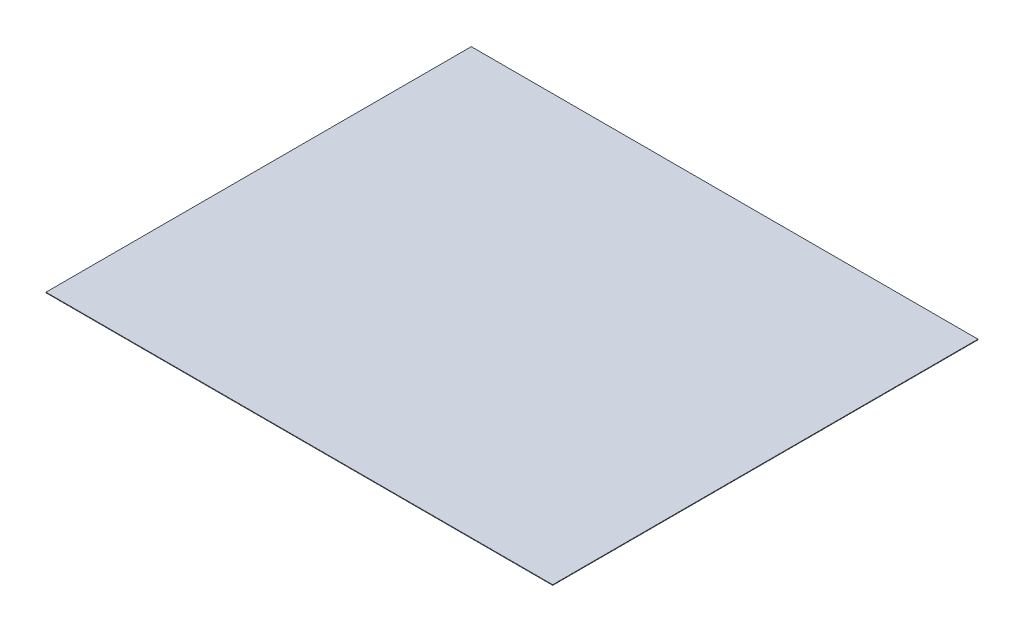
from build123d import *

# Parameters (mm, degrees)
SKIZZE1_W                       = 90378.345394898
SKIZZE1_H                       = 75854.576997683
AUFSATZ_LINEAR_AUSTRAGEN1_DEPTH = 100


with BuildPart() as part:
    # Skizze1 → Aufsatz-Linear austragen1 (new body)
    with BuildSketch(Plane(origin=(0, 0, 0), x_dir=(1, 0, 0), z_dir=(0, 1, 0))):
        with Locations((-1358.635380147, -3166.508049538)):
            Rectangle(SKIZZE1_W, SKIZZE1_H)
    extrude(amount=-AUFSATZ_LINEAR_AUSTRAGEN1_DEPTH)


solid = part.part
